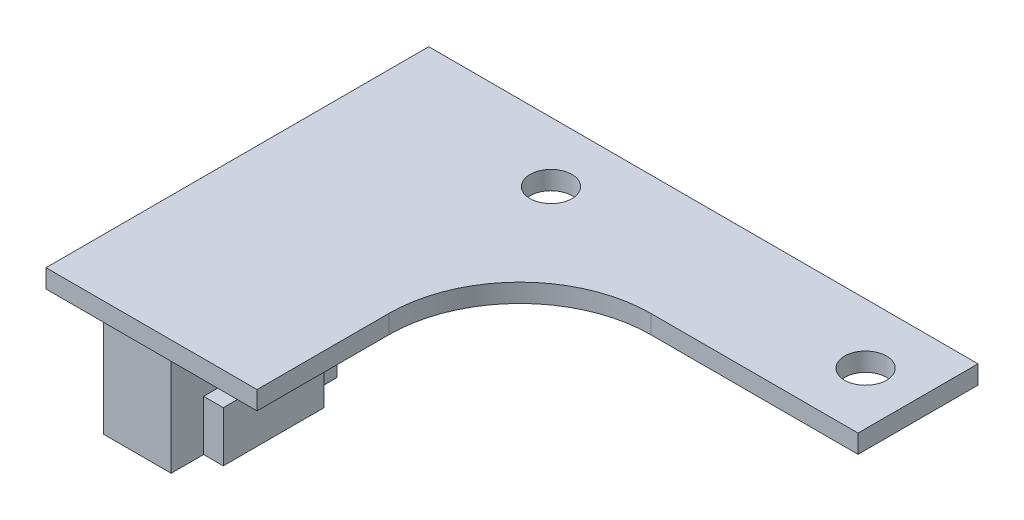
ISO-10303-21;
HEADER;
FILE_DESCRIPTION(('STEP AP214'),'2;1');
FILE_NAME('part.step','',(''),(''),'','','');
FILE_SCHEMA(('AUTOMOTIVE_DESIGN { 1 0 10303 214 1 1 1 1 }'));
ENDSEC;
DATA;
#1=APPLICATION_CONTEXT('core data for automotive mechanical design processes');
#2=APPLICATION_PROTOCOL_DEFINITION('international standard','automotive_design',2000,#1);
#3=PRODUCT_CONTEXT('',#1,'mechanical');
#4=PRODUCT('Part','Part','',(#3));
#5=PRODUCT_RELATED_PRODUCT_CATEGORY('part','',(#4));
#6=PRODUCT_DEFINITION_FORMATION('','',#4);
#7=PRODUCT_DEFINITION_CONTEXT('part definition',#1,'design');
#8=PRODUCT_DEFINITION('design','',#6,#7);
#9=PRODUCT_DEFINITION_SHAPE('','',#8);
#10=(LENGTH_UNIT() NAMED_UNIT(*) SI_UNIT(.MILLI.,.METRE.));
#11=(NAMED_UNIT(*) PLANE_ANGLE_UNIT() SI_UNIT($,.RADIAN.));
#12=(NAMED_UNIT(*) SI_UNIT($,.STERADIAN.) SOLID_ANGLE_UNIT());
#13=UNCERTAINTY_MEASURE_WITH_UNIT(LENGTH_MEASURE(1.E-05),#10,'distance_accuracy_value','');
#14=(GEOMETRIC_REPRESENTATION_CONTEXT(3) GLOBAL_UNCERTAINTY_ASSIGNED_CONTEXT((#13)) GLOBAL_UNIT_ASSIGNED_CONTEXT((#10,
#11,#12)) REPRESENTATION_CONTEXT('',''));
#15=CARTESIAN_POINT('',(0.,0.,0.));
#16=DIRECTION('',(0.,0.,1.));
#17=DIRECTION('',(1.,0.,0.));
#18=AXIS2_PLACEMENT_3D('',#15,#16,#17);
#19=CARTESIAN_POINT('',(-8.75,-11.8,20.225));
#20=DIRECTION('',(-1.,0.,0.));
#21=DIRECTION('',(0.,0.,1.));
#22=AXIS2_PLACEMENT_3D('',#19,#20,#21);
#23=PLANE('',#22);
#24=DIRECTION('',(0.,1.,0.));
#25=VECTOR('',#24,1.);
#26=CARTESIAN_POINT('',(-8.75,-11.8,10.05));
#27=LINE('',#26,#25);
#28=CARTESIAN_POINT('',(-8.75,-11.8,10.05));
#29=VERTEX_POINT('',#28);
#30=CARTESIAN_POINT('',(-8.75,-7.95,10.05));
#31=VERTEX_POINT('',#30);
#32=EDGE_CURVE('E166',#29,#31,#27,.T.);
#33=ORIENTED_EDGE('',*,*,#32,.F.);
#34=DIRECTION('',(0.,0.,1.));
#35=VECTOR('',#34,1.);
#36=CARTESIAN_POINT('',(-8.75,-11.8,20.225));
#37=LINE('',#36,#35);
#38=CARTESIAN_POINT('',(-8.75,-11.8,7.575));
#39=VERTEX_POINT('',#38);
#40=EDGE_CURVE('E174',#39,#29,#37,.T.);
#41=ORIENTED_EDGE('',*,*,#40,.F.);
#42=DIRECTION('',(0.,1.,0.));
#43=VECTOR('',#42,1.);
#44=CARTESIAN_POINT('',(-8.75,-11.8,7.575));
#45=LINE('',#44,#43);
#46=CARTESIAN_POINT('',(-8.75,0.,7.575));
#47=VERTEX_POINT('',#46);
#48=EDGE_CURVE('E184',#39,#47,#45,.T.);
#49=ORIENTED_EDGE('',*,*,#48,.T.);
#50=DIRECTION('',(0.,0.,1.));
#51=VECTOR('',#50,1.);
#52=CARTESIAN_POINT('',(-8.75,0.,20.225));
#53=LINE('',#52,#51);
#54=CARTESIAN_POINT('',(-8.75,0.,20.225));
#55=VERTEX_POINT('',#54);
#56=EDGE_CURVE('E60',#47,#55,#53,.T.);
#57=ORIENTED_EDGE('',*,*,#56,.T.);
#58=DIRECTION('',(0.,1.,0.));
#59=VECTOR('',#58,1.);
#60=CARTESIAN_POINT('',(-8.75,-11.8,20.225));
#61=LINE('',#60,#59);
#62=CARTESIAN_POINT('',(-8.75,-11.8,20.225));
#63=VERTEX_POINT('',#62);
#64=EDGE_CURVE('E198',#63,#55,#61,.T.);
#65=ORIENTED_EDGE('',*,*,#64,.F.);
#66=CARTESIAN_POINT('',(-8.75,-11.8,17.75));
#67=VERTEX_POINT('',#66);
#68=EDGE_CURVE('E178',#67,#63,#37,.T.);
#69=ORIENTED_EDGE('',*,*,#68,.F.);
#70=DIRECTION('',(0.,-1.,0.));
#71=VECTOR('',#70,1.);
#72=CARTESIAN_POINT('',(-8.75,-11.8,17.75));
#73=LINE('',#72,#71);
#74=CARTESIAN_POINT('',(-8.75,-7.95,17.75));
#75=VERTEX_POINT('',#74);
#76=EDGE_CURVE('E162',#75,#67,#73,.T.);
#77=ORIENTED_EDGE('',*,*,#76,.F.);
#78=DIRECTION('',(0.,0.,1.));
#79=VECTOR('',#78,1.);
#80=CARTESIAN_POINT('',(-8.75,-7.95,17.75));
#81=LINE('',#80,#79);
#82=EDGE_CURVE('E308',#31,#75,#81,.T.);
#83=ORIENTED_EDGE('',*,*,#82,.F.);
#84=EDGE_LOOP('',(#33,#41,#49,#57,#65,#69,#77,#83));
#85=FACE_BOUND('',#84,.T.);
#86=ADVANCED_FACE('F37',(#85),#23,.F.);
#87=CARTESIAN_POINT('',(12.2,0.,14.575));
#88=DIRECTION('',(0.,1.,0.));
#89=DIRECTION('',(0.,0.,1.));
#90=AXIS2_PLACEMENT_3D('',#87,#88,#89);
#91=PLANE('',#90);
#92=CARTESIAN_POINT('',(24.,0.,0.));
#93=DIRECTION('',(0.,1.,0.));
#94=DIRECTION('',(0.,0.,1.));
#95=AXIS2_PLACEMENT_3D('',#92,#93,#94);
#96=CIRCLE('',#95,1.6);
#97=CARTESIAN_POINT('',(24.,0.,1.6));
#98=VERTEX_POINT('',#97);
#99=EDGE_CURVE('E201',#98,#98,#96,.T.);
#100=ORIENTED_EDGE('',*,*,#99,.T.);
#101=EDGE_LOOP('',(#100));
#102=FACE_BOUND('',#101,.T.);
#103=CARTESIAN_POINT('',(0.,0.,0.));
#104=DIRECTION('',(0.,1.,0.));
#105=DIRECTION('',(0.,0.,1.));
#106=AXIS2_PLACEMENT_3D('',#103,#104,#105);
#107=CIRCLE('',#106,1.6);
#108=CARTESIAN_POINT('',(0.,0.,1.6));
#109=VERTEX_POINT('',#108);
#110=EDGE_CURVE('E205',#109,#109,#107,.T.);
#111=ORIENTED_EDGE('',*,*,#110,.T.);
#112=EDGE_LOOP('',(#111));
#113=FACE_BOUND('',#112,.T.);
#114=DIRECTION('',(1.,0.,0.));
#115=VECTOR('',#114,1.);
#116=CARTESIAN_POINT('',(-13.9,0.,7.575));
#117=LINE('',#116,#115);
#118=CARTESIAN_POINT('',(-13.9,0.,7.575));
#119=VERTEX_POINT('',#118);
#120=EDGE_CURVE('E188',#119,#47,#117,.T.);
#121=ORIENTED_EDGE('',*,*,#120,.F.);
#122=DIRECTION('',(0.,0.,1.));
#123=VECTOR('',#122,1.);
#124=CARTESIAN_POINT('',(-13.9,0.,-4.57499999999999));
#125=LINE('',#124,#123);
#126=CARTESIAN_POINT('',(-13.9,0.,-4.57499999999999));
#127=VERTEX_POINT('',#126);
#128=EDGE_CURVE('E234',#127,#119,#125,.T.);
#129=ORIENTED_EDGE('',*,*,#128,.F.);
#130=DIRECTION('',(-1.,0.,0.));
#131=VECTOR('',#130,1.);
#132=CARTESIAN_POINT('',(28.,0.,-4.575));
#133=LINE('',#132,#131);
#134=CARTESIAN_POINT('',(28.,0.,-4.575));
#135=VERTEX_POINT('',#134);
#136=EDGE_CURVE('E211',#135,#127,#133,.T.);
#137=ORIENTED_EDGE('',*,*,#136,.F.);
#138=DIRECTION('',(0.,0.,-1.));
#139=VECTOR('',#138,1.);
#140=CARTESIAN_POINT('',(28.,0.,-4.575));
#141=LINE('',#140,#139);
#142=CARTESIAN_POINT('',(28.,0.,4.575));
#143=VERTEX_POINT('',#142);
#144=EDGE_CURVE('E218',#143,#135,#141,.T.);
#145=ORIENTED_EDGE('',*,*,#144,.F.);
#146=DIRECTION('',(1.,0.,0.));
#147=VECTOR('',#146,1.);
#148=CARTESIAN_POINT('',(28.,0.,4.575));
#149=LINE('',#148,#147);
#150=CARTESIAN_POINT('',(12.2000000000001,0.,4.575));
#151=VERTEX_POINT('',#150);
#152=EDGE_CURVE('E243',#151,#143,#149,.T.);
#153=ORIENTED_EDGE('',*,*,#152,.F.);
#154=CARTESIAN_POINT('',(12.2,0.,14.575));
#155=DIRECTION('',(0.,-1.,0.));
#156=DIRECTION('',(0.,0.,1.));
#157=AXIS2_PLACEMENT_3D('',#154,#155,#156);
#158=CIRCLE('',#157,10.);
#159=CARTESIAN_POINT('',(2.2,0.,14.5750000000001));
#160=VERTEX_POINT('',#159);
#161=EDGE_CURVE('E241',#160,#151,#158,.T.);
#162=ORIENTED_EDGE('',*,*,#161,.F.);
#163=DIRECTION('',(0.,0.,-1.));
#164=VECTOR('',#163,1.);
#165=CARTESIAN_POINT('',(2.2,0.,14.5750000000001));
#166=LINE('',#165,#164);
#167=CARTESIAN_POINT('',(2.2,0.,24.625));
#168=VERTEX_POINT('',#167);
#169=EDGE_CURVE('E239',#168,#160,#166,.T.);
#170=ORIENTED_EDGE('',*,*,#169,.F.);
#171=DIRECTION('',(1.,0.,0.));
#172=VECTOR('',#171,1.);
#173=CARTESIAN_POINT('',(-13.9,0.,24.625));
#174=LINE('',#173,#172);
#175=CARTESIAN_POINT('',(-13.9,0.,24.625));
#176=VERTEX_POINT('',#175);
#177=EDGE_CURVE('E237',#176,#168,#174,.T.);
#178=ORIENTED_EDGE('',*,*,#177,.F.);
#179=CARTESIAN_POINT('',(-13.9,0.,20.225));
#180=VERTEX_POINT('',#179);
#181=EDGE_CURVE('E233',#180,#176,#125,.T.);
#182=ORIENTED_EDGE('',*,*,#181,.F.);
#183=DIRECTION('',(-1.,0.,0.));
#184=VECTOR('',#183,1.);
#185=CARTESIAN_POINT('',(-13.9,0.,20.225));
#186=LINE('',#185,#184);
#187=EDGE_CURVE('E169',#55,#180,#186,.T.);
#188=ORIENTED_EDGE('',*,*,#187,.F.);
#189=ORIENTED_EDGE('',*,*,#56,.F.);
#190=EDGE_LOOP('',(#121,#129,#137,#145,#153,#162,#170,#178,#182,#188,#189));
#191=FACE_BOUND('',#190,.T.);
#192=ADVANCED_FACE('F268',(#102,#113,#191),#91,.F.);
#193=CARTESIAN_POINT('',(12.2,1.41,14.575));
#194=DIRECTION('',(0.,1.,0.));
#195=DIRECTION('',(0.,0.,1.));
#196=AXIS2_PLACEMENT_3D('',#193,#194,#195);
#197=PLANE('',#196);
#198=CARTESIAN_POINT('',(0.,1.41,0.));
#199=DIRECTION('',(0.,1.,0.));
#200=DIRECTION('',(0.,0.,1.));
#201=AXIS2_PLACEMENT_3D('',#198,#199,#200);
#202=CIRCLE('',#201,1.6);
#203=CARTESIAN_POINT('',(0.,1.41,1.6));
#204=VERTEX_POINT('',#203);
#205=EDGE_CURVE('E208',#204,#204,#202,.T.);
#206=ORIENTED_EDGE('',*,*,#205,.F.);
#207=EDGE_LOOP('',(#206));
#208=FACE_BOUND('',#207,.T.);
#209=DIRECTION('',(-1.,0.,0.));
#210=VECTOR('',#209,1.);
#211=CARTESIAN_POINT('',(28.,1.41,-4.575));
#212=LINE('',#211,#210);
#213=CARTESIAN_POINT('',(28.,1.41,-4.575));
#214=VERTEX_POINT('',#213);
#215=CARTESIAN_POINT('',(-13.9,1.41,-4.57499999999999));
#216=VERTEX_POINT('',#215);
#217=EDGE_CURVE('E214',#214,#216,#212,.T.);
#218=ORIENTED_EDGE('',*,*,#217,.T.);
#219=DIRECTION('',(0.,0.,1.));
#220=VECTOR('',#219,1.);
#221=CARTESIAN_POINT('',(-13.9,1.41,-4.57499999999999));
#222=LINE('',#221,#220);
#223=CARTESIAN_POINT('',(-13.9,1.41,24.625));
#224=VERTEX_POINT('',#223);
#225=EDGE_CURVE('E217',#216,#224,#222,.T.);
#226=ORIENTED_EDGE('',*,*,#225,.T.);
#227=DIRECTION('',(1.,0.,0.));
#228=VECTOR('',#227,1.);
#229=CARTESIAN_POINT('',(-13.9,1.41,24.625));
#230=LINE('',#229,#228);
#231=CARTESIAN_POINT('',(2.2,1.41,24.625));
#232=VERTEX_POINT('',#231);
#233=EDGE_CURVE('E220',#224,#232,#230,.T.);
#234=ORIENTED_EDGE('',*,*,#233,.T.);
#235=DIRECTION('',(0.,0.,-1.));
#236=VECTOR('',#235,1.);
#237=CARTESIAN_POINT('',(2.2,1.41,14.5750000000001));
#238=LINE('',#237,#236);
#239=CARTESIAN_POINT('',(2.2,1.41,14.5750000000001));
#240=VERTEX_POINT('',#239);
#241=EDGE_CURVE('E222',#232,#240,#238,.T.);
#242=ORIENTED_EDGE('',*,*,#241,.T.);
#243=CARTESIAN_POINT('',(12.2,1.41,14.575));
#244=DIRECTION('',(0.,-1.,0.));
#245=DIRECTION('',(0.,0.,1.));
#246=AXIS2_PLACEMENT_3D('',#243,#244,#245);
#247=CIRCLE('',#246,10.);
#248=CARTESIAN_POINT('',(12.2000000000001,1.41,4.575));
#249=VERTEX_POINT('',#248);
#250=EDGE_CURVE('E224',#240,#249,#247,.T.);
#251=ORIENTED_EDGE('',*,*,#250,.T.);
#252=DIRECTION('',(1.,0.,0.));
#253=VECTOR('',#252,1.);
#254=CARTESIAN_POINT('',(28.,1.41,4.575));
#255=LINE('',#254,#253);
#256=CARTESIAN_POINT('',(28.,1.41,4.575));
#257=VERTEX_POINT('',#256);
#258=EDGE_CURVE('E226',#249,#257,#255,.T.);
#259=ORIENTED_EDGE('',*,*,#258,.T.);
#260=DIRECTION('',(0.,0.,-1.));
#261=VECTOR('',#260,1.);
#262=CARTESIAN_POINT('',(28.,1.41,-4.575));
#263=LINE('',#262,#261);
#264=EDGE_CURVE('E228',#257,#214,#263,.T.);
#265=ORIENTED_EDGE('',*,*,#264,.T.);
#266=EDGE_LOOP('',(#218,#226,#234,#242,#251,#259,#265));
#267=FACE_BOUND('',#266,.T.);
#268=CARTESIAN_POINT('',(24.,1.41,0.));
#269=DIRECTION('',(0.,1.,0.));
#270=DIRECTION('',(0.,0.,1.));
#271=AXIS2_PLACEMENT_3D('',#268,#269,#270);
#272=CIRCLE('',#271,1.6);
#273=CARTESIAN_POINT('',(24.,1.41,1.6));
#274=VERTEX_POINT('',#273);
#275=EDGE_CURVE('E202',#274,#274,#272,.T.);
#276=ORIENTED_EDGE('',*,*,#275,.F.);
#277=EDGE_LOOP('',(#276));
#278=FACE_BOUND('',#277,.T.);
#279=ADVANCED_FACE('F281',(#208,#267,#278),#197,.T.);
#280=CARTESIAN_POINT('',(28.,1.41,-4.575));
#281=DIRECTION('',(0.,0.,1.));
#282=DIRECTION('',(1.,0.,0.));
#283=AXIS2_PLACEMENT_3D('',#280,#281,#282);
#284=PLANE('',#283);
#285=ORIENTED_EDGE('',*,*,#136,.T.);
#286=DIRECTION('',(0.,-1.,0.));
#287=VECTOR('',#286,1.);
#288=CARTESIAN_POINT('',(-13.9,1.41,-4.57499999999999));
#289=LINE('',#288,#287);
#290=EDGE_CURVE('E11',#216,#127,#289,.T.);
#291=ORIENTED_EDGE('',*,*,#290,.F.);
#292=ORIENTED_EDGE('',*,*,#217,.F.);
#293=DIRECTION('',(0.,-1.,0.));
#294=VECTOR('',#293,1.);
#295=CARTESIAN_POINT('',(28.,1.41,-4.575));
#296=LINE('',#295,#294);
#297=EDGE_CURVE('E230',#214,#135,#296,.T.);
#298=ORIENTED_EDGE('',*,*,#297,.T.);
#299=EDGE_LOOP('',(#285,#291,#292,#298));
#300=FACE_BOUND('',#299,.T.);
#301=ADVANCED_FACE('F39',(#300),#284,.F.);
#302=CARTESIAN_POINT('',(-13.9,1.41,-4.57499999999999));
#303=DIRECTION('',(1.,0.,0.));
#304=DIRECTION('',(0.,0.,-1.));
#305=AXIS2_PLACEMENT_3D('',#302,#303,#304);
#306=PLANE('',#305);
#307=ORIENTED_EDGE('',*,*,#128,.T.);
#308=DIRECTION('',(0.,1.,0.));
#309=VECTOR('',#308,1.);
#310=CARTESIAN_POINT('',(-13.9,-11.8,7.575));
#311=LINE('',#310,#309);
#312=CARTESIAN_POINT('',(-13.9,-11.8,7.575));
#313=VERTEX_POINT('',#312);
#314=EDGE_CURVE('E192',#313,#119,#311,.T.);
#315=ORIENTED_EDGE('',*,*,#314,.F.);
#316=DIRECTION('',(0.,0.,-1.));
#317=VECTOR('',#316,1.);
#318=CARTESIAN_POINT('',(-13.9,-11.8,20.225));
#319=LINE('',#318,#317);
#320=CARTESIAN_POINT('',(-13.9,-11.8,20.225));
#321=VERTEX_POINT('',#320);
#322=EDGE_CURVE('E180',#321,#313,#319,.T.);
#323=ORIENTED_EDGE('',*,*,#322,.F.);
#324=DIRECTION('',(0.,1.,0.));
#325=VECTOR('',#324,1.);
#326=CARTESIAN_POINT('',(-13.9,-11.8,20.225));
#327=LINE('',#326,#325);
#328=EDGE_CURVE('E195',#321,#180,#327,.T.);
#329=ORIENTED_EDGE('',*,*,#328,.T.);
#330=ORIENTED_EDGE('',*,*,#181,.T.);
#331=DIRECTION('',(0.,-1.,0.));
#332=VECTOR('',#331,1.);
#333=CARTESIAN_POINT('',(-13.9,1.41,24.625));
#334=LINE('',#333,#332);
#335=EDGE_CURVE('E45',#224,#176,#334,.T.);
#336=ORIENTED_EDGE('',*,*,#335,.F.);
#337=ORIENTED_EDGE('',*,*,#225,.F.);
#338=ORIENTED_EDGE('',*,*,#290,.T.);
#339=EDGE_LOOP('',(#307,#315,#323,#329,#330,#336,#337,#338));
#340=FACE_BOUND('',#339,.T.);
#341=ADVANCED_FACE('F286',(#340),#306,.F.);
#342=CARTESIAN_POINT('',(-13.9,1.41,24.625));
#343=DIRECTION('',(0.,0.,-1.));
#344=DIRECTION('',(-1.,0.,0.));
#345=AXIS2_PLACEMENT_3D('',#342,#343,#344);
#346=PLANE('',#345);
#347=ORIENTED_EDGE('',*,*,#177,.T.);
#348=DIRECTION('',(0.,-1.,0.));
#349=VECTOR('',#348,1.);
#350=CARTESIAN_POINT('',(2.2,1.41,24.625));
#351=LINE('',#350,#349);
#352=EDGE_CURVE('E257',#232,#168,#351,.T.);
#353=ORIENTED_EDGE('',*,*,#352,.F.);
#354=ORIENTED_EDGE('',*,*,#233,.F.);
#355=ORIENTED_EDGE('',*,*,#335,.T.);
#356=EDGE_LOOP('',(#347,#353,#354,#355));
#357=FACE_BOUND('',#356,.T.);
#358=ADVANCED_FACE('F264',(#357),#346,.F.);
#359=CARTESIAN_POINT('',(2.2,1.41,14.5750000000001));
#360=DIRECTION('',(-1.,0.,0.));
#361=DIRECTION('',(0.,0.,1.));
#362=AXIS2_PLACEMENT_3D('',#359,#360,#361);
#363=PLANE('',#362);
#364=ORIENTED_EDGE('',*,*,#169,.T.);
#365=DIRECTION('',(0.,-1.,0.));
#366=VECTOR('',#365,1.);
#367=CARTESIAN_POINT('',(2.2,1.41,14.5750000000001));
#368=LINE('',#367,#366);
#369=EDGE_CURVE('E254',#240,#160,#368,.T.);
#370=ORIENTED_EDGE('',*,*,#369,.F.);
#371=ORIENTED_EDGE('',*,*,#241,.F.);
#372=ORIENTED_EDGE('',*,*,#352,.T.);
#373=EDGE_LOOP('',(#364,#370,#371,#372));
#374=FACE_BOUND('',#373,.T.);
#375=ADVANCED_FACE('F273',(#374),#363,.F.);
#376=CARTESIAN_POINT('',(12.2,1.41,14.575));
#377=DIRECTION('',(0.,-1.,0.));
#378=DIRECTION('',(0.,0.,-1.));
#379=AXIS2_PLACEMENT_3D('',#376,#377,#378);
#380=CYLINDRICAL_SURFACE('',#379,10.);
#381=ORIENTED_EDGE('',*,*,#161,.T.);
#382=DIRECTION('',(0.,-1.,0.));
#383=VECTOR('',#382,1.);
#384=CARTESIAN_POINT('',(12.2000000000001,1.41,4.575));
#385=LINE('',#384,#383);
#386=EDGE_CURVE('E251',#249,#151,#385,.T.);
#387=ORIENTED_EDGE('',*,*,#386,.F.);
#388=ORIENTED_EDGE('',*,*,#250,.F.);
#389=ORIENTED_EDGE('',*,*,#369,.T.);
#390=EDGE_LOOP('',(#381,#387,#388,#389));
#391=FACE_BOUND('',#390,.T.);
#392=ADVANCED_FACE('F277',(#391),#380,.F.);
#393=CARTESIAN_POINT('',(28.,1.41,4.575));
#394=DIRECTION('',(0.,0.,-1.));
#395=DIRECTION('',(-1.,0.,0.));
#396=AXIS2_PLACEMENT_3D('',#393,#394,#395);
#397=PLANE('',#396);
#398=ORIENTED_EDGE('',*,*,#152,.T.);
#399=DIRECTION('',(0.,-1.,0.));
#400=VECTOR('',#399,1.);
#401=CARTESIAN_POINT('',(28.,1.41,4.575));
#402=LINE('',#401,#400);
#403=EDGE_CURVE('E248',#257,#143,#402,.T.);
#404=ORIENTED_EDGE('',*,*,#403,.F.);
#405=ORIENTED_EDGE('',*,*,#258,.F.);
#406=ORIENTED_EDGE('',*,*,#386,.T.);
#407=EDGE_LOOP('',(#398,#404,#405,#406));
#408=FACE_BOUND('',#407,.T.);
#409=ADVANCED_FACE('F349',(#408),#397,.F.);
#410=CARTESIAN_POINT('',(28.,1.41,-4.575));
#411=DIRECTION('',(-1.,0.,0.));
#412=DIRECTION('',(0.,0.,1.));
#413=AXIS2_PLACEMENT_3D('',#410,#411,#412);
#414=PLANE('',#413);
#415=ORIENTED_EDGE('',*,*,#144,.T.);
#416=ORIENTED_EDGE('',*,*,#297,.F.);
#417=ORIENTED_EDGE('',*,*,#264,.F.);
#418=ORIENTED_EDGE('',*,*,#403,.T.);
#419=EDGE_LOOP('',(#415,#416,#417,#418));
#420=FACE_BOUND('',#419,.T.);
#421=ADVANCED_FACE('F342',(#420),#414,.F.);
#422=CARTESIAN_POINT('',(0.,1.41,0.));
#423=DIRECTION('',(0.,-1.,0.));
#424=DIRECTION('',(0.,0.,-1.));
#425=AXIS2_PLACEMENT_3D('',#422,#423,#424);
#426=CYLINDRICAL_SURFACE('',#425,1.6);
#427=ORIENTED_EDGE('',*,*,#205,.T.);
#428=EDGE_LOOP('',(#427));
#429=FACE_BOUND('',#428,.T.);
#430=ORIENTED_EDGE('',*,*,#110,.F.);
#431=EDGE_LOOP('',(#430));
#432=FACE_BOUND('',#431,.T.);
#433=ADVANCED_FACE('F338',(#429,#432),#426,.F.);
#434=CARTESIAN_POINT('',(24.,1.41,0.));
#435=DIRECTION('',(0.,-1.,0.));
#436=DIRECTION('',(0.,0.,-1.));
#437=AXIS2_PLACEMENT_3D('',#434,#435,#436);
#438=CYLINDRICAL_SURFACE('',#437,1.6);
#439=ORIENTED_EDGE('',*,*,#275,.T.);
#440=EDGE_LOOP('',(#439));
#441=FACE_BOUND('',#440,.T.);
#442=ORIENTED_EDGE('',*,*,#99,.F.);
#443=EDGE_LOOP('',(#442));
#444=FACE_BOUND('',#443,.T.);
#445=ADVANCED_FACE('F335',(#441,#444),#438,.F.);
#446=CARTESIAN_POINT('',(-13.9,-11.8,20.225));
#447=DIRECTION('',(0.,0.,-1.));
#448=DIRECTION('',(-1.,0.,0.));
#449=AXIS2_PLACEMENT_3D('',#446,#447,#448);
#450=PLANE('',#449);
#451=ORIENTED_EDGE('',*,*,#187,.T.);
#452=ORIENTED_EDGE('',*,*,#328,.F.);
#453=DIRECTION('',(-1.,0.,0.));
#454=VECTOR('',#453,1.);
#455=CARTESIAN_POINT('',(-13.9,-11.8,20.225));
#456=LINE('',#455,#454);
#457=EDGE_CURVE('E177',#63,#321,#456,.T.);
#458=ORIENTED_EDGE('',*,*,#457,.F.);
#459=ORIENTED_EDGE('',*,*,#64,.T.);
#460=EDGE_LOOP('',(#451,#452,#458,#459));
#461=FACE_BOUND('',#460,.T.);
#462=ADVANCED_FACE('F305',(#461),#450,.F.);
#463=CARTESIAN_POINT('',(-13.9,-11.8,7.575));
#464=DIRECTION('',(0.,0.,1.));
#465=DIRECTION('',(1.,0.,0.));
#466=AXIS2_PLACEMENT_3D('',#463,#464,#465);
#467=PLANE('',#466);
#468=ORIENTED_EDGE('',*,*,#120,.T.);
#469=ORIENTED_EDGE('',*,*,#48,.F.);
#470=DIRECTION('',(1.,0.,0.));
#471=VECTOR('',#470,1.);
#472=CARTESIAN_POINT('',(-13.9,-11.8,7.575));
#473=LINE('',#472,#471);
#474=EDGE_CURVE('E183',#313,#39,#473,.T.);
#475=ORIENTED_EDGE('',*,*,#474,.F.);
#476=ORIENTED_EDGE('',*,*,#314,.T.);
#477=EDGE_LOOP('',(#468,#469,#475,#476));
#478=FACE_BOUND('',#477,.T.);
#479=ADVANCED_FACE('F294',(#478),#467,.F.);
#480=CARTESIAN_POINT('',(0.,-11.8,0.));
#481=DIRECTION('',(0.,-1.,0.));
#482=DIRECTION('',(0.,0.,-1.));
#483=AXIS2_PLACEMENT_3D('',#480,#481,#482);
#484=PLANE('',#483);
#485=ORIENTED_EDGE('',*,*,#40,.T.);
#486=DIRECTION('',(-1.,0.,0.));
#487=VECTOR('',#486,1.);
#488=CARTESIAN_POINT('',(-7.25,-11.8,10.05));
#489=LINE('',#488,#487);
#490=CARTESIAN_POINT('',(-7.25,-11.8,10.05));
#491=VERTEX_POINT('',#490);
#492=EDGE_CURVE('E300',#491,#29,#489,.T.);
#493=ORIENTED_EDGE('',*,*,#492,.F.);
#494=DIRECTION('',(0.,0.,-1.));
#495=VECTOR('',#494,1.);
#496=CARTESIAN_POINT('',(-7.25,-11.8,17.75));
#497=LINE('',#496,#495);
#498=CARTESIAN_POINT('',(-7.25,-11.8,17.75));
#499=VERTEX_POINT('',#498);
#500=EDGE_CURVE('E159',#499,#491,#497,.T.);
#501=ORIENTED_EDGE('',*,*,#500,.F.);
#502=DIRECTION('',(-1.,0.,0.));
#503=VECTOR('',#502,1.);
#504=CARTESIAN_POINT('',(-7.25,-11.8,17.75));
#505=LINE('',#504,#503);
#506=EDGE_CURVE('E52',#499,#67,#505,.T.);
#507=ORIENTED_EDGE('',*,*,#506,.T.);
#508=ORIENTED_EDGE('',*,*,#68,.T.);
#509=ORIENTED_EDGE('',*,*,#457,.T.);
#510=ORIENTED_EDGE('',*,*,#322,.T.);
#511=ORIENTED_EDGE('',*,*,#474,.T.);
#512=EDGE_LOOP('',(#485,#493,#501,#507,#508,#509,#510,#511));
#513=FACE_BOUND('',#512,.T.);
#514=ADVANCED_FACE('F299',(#513),#484,.T.);
#515=CARTESIAN_POINT('',(-7.25,-11.8,10.05));
#516=DIRECTION('',(0.,0.,1.));
#517=DIRECTION('',(1.,0.,0.));
#518=AXIS2_PLACEMENT_3D('',#515,#516,#517);
#519=PLANE('',#518);
#520=ORIENTED_EDGE('',*,*,#32,.T.);
#521=DIRECTION('',(-1.,0.,0.));
#522=VECTOR('',#521,1.);
#523=CARTESIAN_POINT('',(-7.25,-7.95,10.05));
#524=LINE('',#523,#522);
#525=CARTESIAN_POINT('',(-7.25,-7.95,10.05));
#526=VERTEX_POINT('',#525);
#527=EDGE_CURVE('E148',#526,#31,#524,.T.);
#528=ORIENTED_EDGE('',*,*,#527,.F.);
#529=DIRECTION('',(0.,1.,0.));
#530=VECTOR('',#529,1.);
#531=CARTESIAN_POINT('',(-7.25,-11.8,10.05));
#532=LINE('',#531,#530);
#533=EDGE_CURVE('E155',#491,#526,#532,.T.);
#534=ORIENTED_EDGE('',*,*,#533,.F.);
#535=ORIENTED_EDGE('',*,*,#492,.T.);
#536=EDGE_LOOP('',(#520,#528,#534,#535));
#537=FACE_BOUND('',#536,.T.);
#538=ADVANCED_FACE('F164',(#537),#519,.F.);
#539=CARTESIAN_POINT('',(-7.25,-7.95,17.75));
#540=DIRECTION('',(0.,-1.,0.));
#541=DIRECTION('',(0.,0.,-1.));
#542=AXIS2_PLACEMENT_3D('',#539,#540,#541);
#543=PLANE('',#542);
#544=ORIENTED_EDGE('',*,*,#82,.T.);
#545=DIRECTION('',(-1.,0.,0.));
#546=VECTOR('',#545,1.);
#547=CARTESIAN_POINT('',(-7.25,-7.95,17.75));
#548=LINE('',#547,#546);
#549=CARTESIAN_POINT('',(-7.25,-7.95,17.75));
#550=VERTEX_POINT('',#549);
#551=EDGE_CURVE('E151',#550,#75,#548,.T.);
#552=ORIENTED_EDGE('',*,*,#551,.F.);
#553=DIRECTION('',(0.,0.,1.));
#554=VECTOR('',#553,1.);
#555=CARTESIAN_POINT('',(-7.25,-7.95,17.75));
#556=LINE('',#555,#554);
#557=EDGE_CURVE('E144',#526,#550,#556,.T.);
#558=ORIENTED_EDGE('',*,*,#557,.F.);
#559=ORIENTED_EDGE('',*,*,#527,.T.);
#560=EDGE_LOOP('',(#544,#552,#558,#559));
#561=FACE_BOUND('',#560,.T.);
#562=ADVANCED_FACE('F146',(#561),#543,.F.);
#563=CARTESIAN_POINT('',(-7.25,-11.8,17.75));
#564=DIRECTION('',(0.,0.,-1.));
#565=DIRECTION('',(-1.,0.,0.));
#566=AXIS2_PLACEMENT_3D('',#563,#564,#565);
#567=PLANE('',#566);
#568=ORIENTED_EDGE('',*,*,#76,.T.);
#569=ORIENTED_EDGE('',*,*,#506,.F.);
#570=DIRECTION('',(0.,-1.,0.));
#571=VECTOR('',#570,1.);
#572=CARTESIAN_POINT('',(-7.25,-11.8,17.75));
#573=LINE('',#572,#571);
#574=EDGE_CURVE('E154',#550,#499,#573,.T.);
#575=ORIENTED_EDGE('',*,*,#574,.F.);
#576=ORIENTED_EDGE('',*,*,#551,.T.);
#577=EDGE_LOOP('',(#568,#569,#575,#576));
#578=FACE_BOUND('',#577,.T.);
#579=ADVANCED_FACE('F316',(#578),#567,.F.);
#580=CARTESIAN_POINT('',(-7.25,0.,0.));
#581=DIRECTION('',(-1.,0.,0.));
#582=DIRECTION('',(0.,0.,1.));
#583=AXIS2_PLACEMENT_3D('',#580,#581,#582);
#584=PLANE('',#583);
#585=ORIENTED_EDGE('',*,*,#533,.T.);
#586=ORIENTED_EDGE('',*,*,#557,.T.);
#587=ORIENTED_EDGE('',*,*,#574,.T.);
#588=ORIENTED_EDGE('',*,*,#500,.T.);
#589=EDGE_LOOP('',(#585,#586,#587,#588));
#590=FACE_BOUND('',#589,.T.);
#591=ADVANCED_FACE('F158',(#590),#584,.F.);
#592=CLOSED_SHELL('',(#86,#192,#279,#301,#341,#358,#375,#392,#409,#421,#433,#445,#462,#479,#514,
#538,#562,#579,#591));
#593=MANIFOLD_SOLID_BREP('B2',#592);
#594=ADVANCED_BREP_SHAPE_REPRESENTATION('',(#18,#593),#14);
#595=SHAPE_DEFINITION_REPRESENTATION(#9,#594);
ENDSEC;
END-ISO-10303-21;
